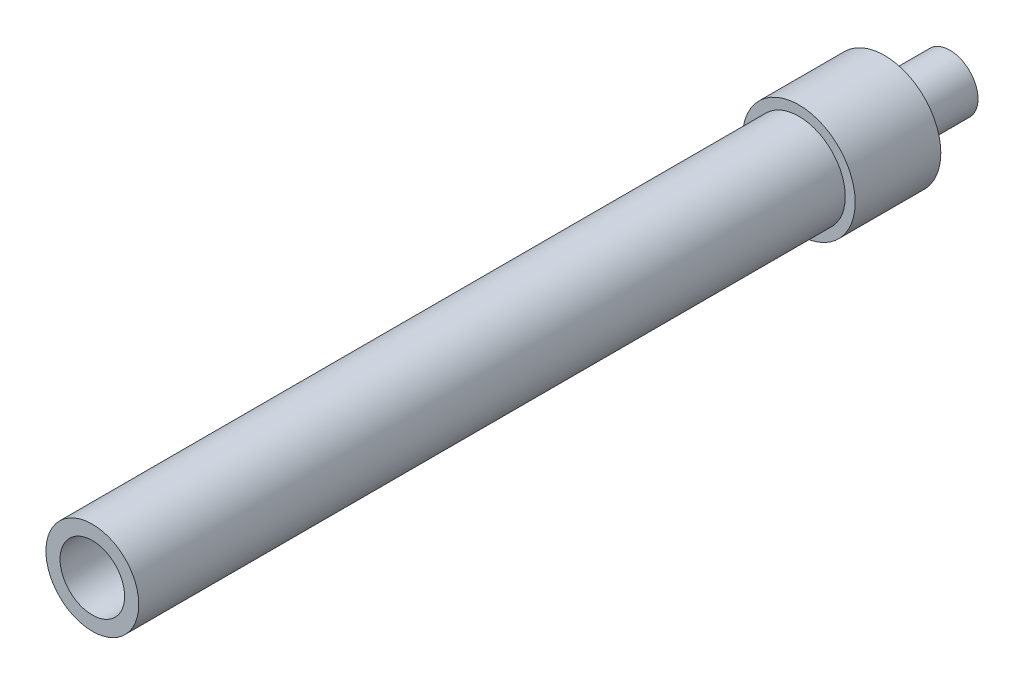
from build123d import *

# Parameters (mm, degrees)
SKETCH1_R          = 5.2324
SKETCH1_R_2        = 3.63855
EXTRUDE1_DEPTH     = 89.281
SKETCH2_R          = 6.35
EXTRUDE2_DEPTH     = 9.652
SKETCH3_R          = 3.175
EXTRUDE3_DEPTH     = 7.366
SKETCH5_R          = 0.9652
CUT_EXTRUDE1_DEPTH = 98.063317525


with BuildPart() as part:
    # Sketch1 → Extrude1 (new body)
    with BuildSketch(Plane.XY):
        Circle(SKETCH1_R)
        Circle(SKETCH1_R_2, mode=Mode.SUBTRACT)
    extrude(amount=EXTRUDE1_DEPTH)

    # Sketch2 → Extrude2 (add)
    with BuildSketch(Plane.XY):
        Circle(SKETCH2_R)
    extrude(amount=EXTRUDE2_DEPTH)

    # Sketch3 → Extrude3 (add)
    with BuildSketch(Plane(origin=(0, 0, 0), x_dir=(-1, 0, 0), z_dir=(0, 0, -1))):
        with Locations(Location((0, 0, 0), (0, 0, 180))):
            Circle(SKETCH3_R)
    extrude(amount=EXTRUDE3_DEPTH)

    # Sketch5 → Cut-Extrude1 (cut, through all)
    with BuildSketch(Plane(origin=(0, 0, -7.366), x_dir=(-1, 0, 0), z_dir=(0, 0, -1))):
        Circle(SKETCH5_R)
    extrude(amount=-CUT_EXTRUDE1_DEPTH, mode=Mode.SUBTRACT)


solid = part.part
